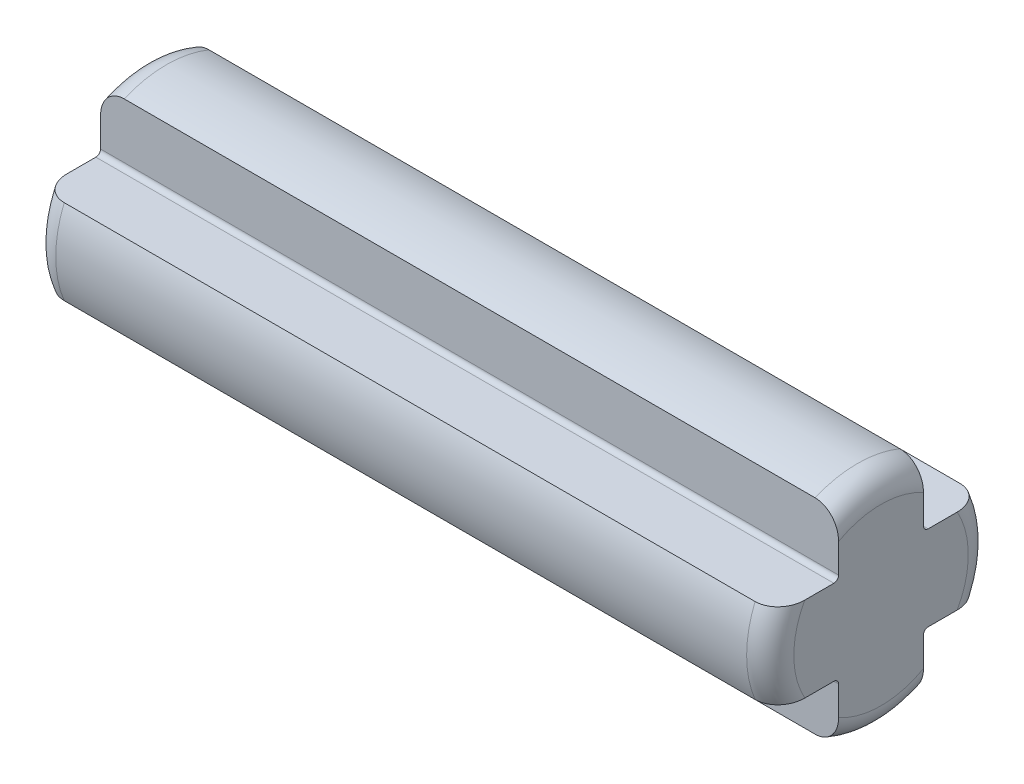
ISO-10303-21;
HEADER;
FILE_DESCRIPTION(('STEP AP214'),'2;1');
FILE_NAME('part.step','',(''),(''),'','','');
FILE_SCHEMA(('AUTOMOTIVE_DESIGN { 1 0 10303 214 1 1 1 1 }'));
ENDSEC;
DATA;
#1=APPLICATION_CONTEXT('core data for automotive mechanical design processes');
#2=APPLICATION_PROTOCOL_DEFINITION('international standard','automotive_design',2000,#1);
#3=PRODUCT_CONTEXT('',#1,'mechanical');
#4=PRODUCT('Part','Part','',(#3));
#5=PRODUCT_RELATED_PRODUCT_CATEGORY('part','',(#4));
#6=PRODUCT_DEFINITION_FORMATION('','',#4);
#7=PRODUCT_DEFINITION_CONTEXT('part definition',#1,'design');
#8=PRODUCT_DEFINITION('design','',#6,#7);
#9=PRODUCT_DEFINITION_SHAPE('','',#8);
#10=(LENGTH_UNIT() NAMED_UNIT(*) SI_UNIT(.MILLI.,.METRE.));
#11=(NAMED_UNIT(*) PLANE_ANGLE_UNIT() SI_UNIT($,.RADIAN.));
#12=(NAMED_UNIT(*) SI_UNIT($,.STERADIAN.) SOLID_ANGLE_UNIT());
#13=UNCERTAINTY_MEASURE_WITH_UNIT(LENGTH_MEASURE(1.E-05),#10,'distance_accuracy_value','');
#14=(GEOMETRIC_REPRESENTATION_CONTEXT(3) GLOBAL_UNCERTAINTY_ASSIGNED_CONTEXT((#13)) GLOBAL_UNIT_ASSIGNED_CONTEXT((#10,
#11,#12)) REPRESENTATION_CONTEXT('',''));
#15=CARTESIAN_POINT('',(0.,0.,0.));
#16=DIRECTION('',(0.,0.,1.));
#17=DIRECTION('',(1.,0.,0.));
#18=AXIS2_PLACEMENT_3D('',#15,#16,#17);
#19=CARTESIAN_POINT('',(7.825,0.,0.));
#20=DIRECTION('',(-1.,0.,0.));
#21=DIRECTION('',(0.,0.,1.));
#22=AXIS2_PLACEMENT_3D('',#19,#20,#21);
#23=CYLINDRICAL_SURFACE('',#22,2.35);
#24=DIRECTION('',(-1.,0.,0.));
#25=VECTOR('',#24,1.);
#26=CARTESIAN_POINT('',(7.825,0.9,2.17082933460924));
#27=LINE('',#26,#25);
#28=CARTESIAN_POINT('',(7.325,0.9,2.17082933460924));
#29=VERTEX_POINT('',#28);
#30=CARTESIAN_POINT('',(-7.325,0.9,2.17082933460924));
#31=VERTEX_POINT('',#30);
#32=EDGE_CURVE('E250',#29,#31,#27,.T.);
#33=ORIENTED_EDGE('',*,*,#32,.T.);
#34=CARTESIAN_POINT('',(-7.325,0.,0.));
#35=DIRECTION('',(1.,0.,0.));
#36=DIRECTION('',(0.,0.,-1.));
#37=AXIS2_PLACEMENT_3D('',#34,#35,#36);
#38=CIRCLE('',#37,2.35);
#39=CARTESIAN_POINT('',(-7.325,-0.900000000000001,2.17082933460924));
#40=VERTEX_POINT('',#39);
#41=EDGE_CURVE('E515',#31,#40,#38,.T.);
#42=ORIENTED_EDGE('',*,*,#41,.T.);
#43=DIRECTION('',(-1.,0.,0.));
#44=VECTOR('',#43,1.);
#45=CARTESIAN_POINT('',(7.825,-0.900000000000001,2.17082933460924));
#46=LINE('',#45,#44);
#47=CARTESIAN_POINT('',(7.325,-0.900000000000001,2.17082933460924));
#48=VERTEX_POINT('',#47);
#49=EDGE_CURVE('E221',#48,#40,#46,.T.);
#50=ORIENTED_EDGE('',*,*,#49,.F.);
#51=CARTESIAN_POINT('',(7.325,0.,0.));
#52=DIRECTION('',(1.,0.,0.));
#53=DIRECTION('',(0.,0.,-1.));
#54=AXIS2_PLACEMENT_3D('',#51,#52,#53);
#55=CIRCLE('',#54,2.35);
#56=EDGE_CURVE('E370',#48,#29,#55,.F.);
#57=ORIENTED_EDGE('',*,*,#56,.T.);
#58=EDGE_LOOP('',(#33,#42,#50,#57));
#59=FACE_BOUND('',#58,.T.);
#60=ADVANCED_FACE('F37',(#59),#23,.T.);
#61=CARTESIAN_POINT('',(7.825,-0.900000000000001,2.17082933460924));
#62=DIRECTION('',(0.,1.,0.));
#63=DIRECTION('',(0.,0.,1.));
#64=AXIS2_PLACEMENT_3D('',#61,#62,#63);
#65=PLANE('',#64);
#66=ORIENTED_EDGE('',*,*,#49,.T.);
#67=CARTESIAN_POINT('',(-7.325,-0.900000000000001,2.17082933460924));
#68=CARTESIAN_POINT('',(-7.35148338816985,-0.900000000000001,2.17085986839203));
#69=CARTESIAN_POINT('',(-7.37794986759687,-0.900000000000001,2.16855372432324));
#70=CARTESIAN_POINT('',(-7.43004532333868,-0.900000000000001,2.15950506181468));
#71=CARTESIAN_POINT('',(-7.45567629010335,-0.900000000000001,2.15277404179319));
#72=CARTESIAN_POINT('',(-7.50543871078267,-0.900000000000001,2.1351114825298));
#73=CARTESIAN_POINT('',(-7.52957034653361,-0.900000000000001,2.12418045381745));
#74=CARTESIAN_POINT('',(-7.57572512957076,-0.900000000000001,2.09852306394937));
#75=CARTESIAN_POINT('',(-7.59774756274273,-0.900000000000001,2.0837954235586));
#76=CARTESIAN_POINT('',(-7.6397234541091,-0.900000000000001,2.05060839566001));
#77=CARTESIAN_POINT('',(-7.6596070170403,-0.900000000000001,2.03206082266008));
#78=CARTESIAN_POINT('',(-7.69622437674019,-0.900000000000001,1.99209288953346));
#79=CARTESIAN_POINT('',(-7.71295793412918,-0.900000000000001,1.97067231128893));
#80=CARTESIAN_POINT('',(-7.74409731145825,-0.900000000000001,1.92396602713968));
#81=CARTESIAN_POINT('',(-7.75825279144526,-0.900000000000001,1.89851375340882));
#82=CARTESIAN_POINT('',(-7.78252472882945,-0.900000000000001,1.84573102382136));
#83=CARTESIAN_POINT('',(-7.79263675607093,-0.900000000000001,1.81839854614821));
#84=CARTESIAN_POINT('',(-7.80888669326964,-0.900000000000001,1.76219756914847));
#85=CARTESIAN_POINT('',(-7.81497027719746,-0.900000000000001,1.73331353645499));
#86=CARTESIAN_POINT('',(-7.82302704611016,-0.900000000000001,1.67505065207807));
#87=CARTESIAN_POINT('',(-7.82501091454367,-0.900000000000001,1.64567328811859));
#88=CARTESIAN_POINT('',(-7.825,-0.900000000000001,1.61632298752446));
#89=B_SPLINE_CURVE_WITH_KNOTS('',3,(#67,#68,#69,#70,#71,#72,#73,#74,#75,#76,#77,#78,#79,#80,#81,
#82,#83,#84,#85,#86,#87,#88),.UNSPECIFIED.,.F.,.F.,(4,2,2,2,2,2,2,2,2,2,4),(0.,
0.0793238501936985,0.158442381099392,0.237551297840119,0.316686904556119,0.397909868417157,
0.479139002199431,0.566147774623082,0.653251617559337,0.741507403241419,0.829532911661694),.UNSPECIFIED.);
#90=CARTESIAN_POINT('',(-7.825,-0.900000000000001,1.61632298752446));
#91=VERTEX_POINT('',#90);
#92=EDGE_CURVE('E390',#40,#91,#89,.T.);
#93=ORIENTED_EDGE('',*,*,#92,.T.);
#94=DIRECTION('',(0.,0.,-1.));
#95=VECTOR('',#94,1.);
#96=CARTESIAN_POINT('',(-7.825,-0.900000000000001,2.17082933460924));
#97=LINE('',#96,#95);
#98=CARTESIAN_POINT('',(-7.825,-0.900000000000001,0.999999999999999));
#99=VERTEX_POINT('',#98);
#100=EDGE_CURVE('E218',#91,#99,#97,.T.);
#101=ORIENTED_EDGE('',*,*,#100,.T.);
#102=DIRECTION('',(-1.,0.,0.));
#103=VECTOR('',#102,1.);
#104=CARTESIAN_POINT('',(7.825,-0.900000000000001,0.999999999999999));
#105=LINE('',#104,#103);
#106=CARTESIAN_POINT('',(7.825,-0.900000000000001,0.999999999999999));
#107=VERTEX_POINT('',#106);
#108=EDGE_CURVE('E214',#107,#99,#105,.T.);
#109=ORIENTED_EDGE('',*,*,#108,.F.);
#110=DIRECTION('',(0.,0.,-1.));
#111=VECTOR('',#110,1.);
#112=CARTESIAN_POINT('',(7.825,-0.900000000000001,2.17082933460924));
#113=LINE('',#112,#111);
#114=CARTESIAN_POINT('',(7.825,-0.900000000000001,1.61632298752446));
#115=VERTEX_POINT('',#114);
#116=EDGE_CURVE('E201',#115,#107,#113,.T.);
#117=ORIENTED_EDGE('',*,*,#116,.F.);
#118=CARTESIAN_POINT('',(7.825,-0.900000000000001,1.61632298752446));
#119=CARTESIAN_POINT('',(7.8250222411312,-0.900000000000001,1.65066661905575));
#120=CARTESIAN_POINT('',(7.8222983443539,-0.900000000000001,1.68506058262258));
#121=CARTESIAN_POINT('',(7.8112156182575,-0.900000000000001,1.75308687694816));
#122=CARTESIAN_POINT('',(7.80283034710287,-0.900000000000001,1.78671486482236));
#123=CARTESIAN_POINT('',(7.78024199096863,-0.900000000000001,1.85211366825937));
#124=CARTESIAN_POINT('',(7.76601955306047,-0.900000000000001,1.88387790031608));
#125=CARTESIAN_POINT('',(7.73191319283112,-0.900000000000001,1.94414749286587));
#126=CARTESIAN_POINT('',(7.71204168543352,-0.900000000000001,1.97265980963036));
#127=CARTESIAN_POINT('',(7.66922246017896,-0.900000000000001,2.02268935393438));
#128=CARTESIAN_POINT('',(7.64675261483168,-0.900000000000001,2.04461521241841));
#129=CARTESIAN_POINT('',(7.59808909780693,-0.900000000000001,2.08389547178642));
#130=CARTESIAN_POINT('',(7.57189528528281,-0.900000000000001,2.10124969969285));
#131=CARTESIAN_POINT('',(7.51934384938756,-0.900000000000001,2.12912089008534));
#132=CARTESIAN_POINT('',(7.49325091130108,-0.900000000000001,2.14013932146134));
#133=CARTESIAN_POINT('',(7.43953410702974,-0.900000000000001,2.15730052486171));
#134=CARTESIAN_POINT('',(7.41191341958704,-0.900000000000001,2.1634530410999));
#135=CARTESIAN_POINT('',(7.37421356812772,-0.900000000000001,2.16830749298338));
#136=CARTESIAN_POINT('',(7.36438668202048,-0.900000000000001,2.1692533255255));
#137=CARTESIAN_POINT('',(7.34470815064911,-0.900000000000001,2.17051341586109));
#138=CARTESIAN_POINT('',(7.33485656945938,-0.900000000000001,2.17082867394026));
#139=CARTESIAN_POINT('',(7.325,-0.900000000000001,2.17082933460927));
#140=B_SPLINE_CURVE_WITH_KNOTS('',3,(#118,#119,#120,#121,#122,#123,#124,#125,#126,#127,#128,
#129,#130,#131,#132,#133,#134,#135,#136,#137,#138,#139),.UNSPECIFIED.,.F.,.F.,(4,2,2,2,2,2,2,2,
2,2,4),(0.,0.10300027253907,0.206484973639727,0.310315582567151,0.413919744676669,
0.507586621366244,0.601257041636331,0.685799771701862,0.770172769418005,0.799774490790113,
0.829329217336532),.UNSPECIFIED.);
#141=EDGE_CURVE('E520',#115,#48,#140,.T.);
#142=ORIENTED_EDGE('',*,*,#141,.T.);
#143=EDGE_LOOP('',(#66,#93,#101,#109,#117,#142));
#144=FACE_BOUND('',#143,.T.);
#145=ADVANCED_FACE('F216',(#144),#65,.F.);
#146=CARTESIAN_POINT('',(7.825,-1.,0.999999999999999));
#147=DIRECTION('',(-1.,0.,0.));
#148=DIRECTION('',(0.,0.,1.));
#149=AXIS2_PLACEMENT_3D('',#146,#147,#148);
#150=CYLINDRICAL_SURFACE('',#149,0.0999999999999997);
#151=CARTESIAN_POINT('',(-7.825,-1.,0.999999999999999));
#152=DIRECTION('',(-1.,0.,0.));
#153=DIRECTION('',(0.,0.,1.));
#154=AXIS2_PLACEMENT_3D('',#151,#152,#153);
#155=CIRCLE('',#154,0.0999999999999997);
#156=CARTESIAN_POINT('',(-7.825,-1.,0.899999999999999));
#157=VERTEX_POINT('',#156);
#158=EDGE_CURVE('E252',#99,#157,#155,.T.);
#159=ORIENTED_EDGE('',*,*,#158,.T.);
#160=DIRECTION('',(-1.,0.,0.));
#161=VECTOR('',#160,1.);
#162=CARTESIAN_POINT('',(7.825,-1.,0.899999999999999));
#163=LINE('',#162,#161);
#164=CARTESIAN_POINT('',(7.825,-1.,0.899999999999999));
#165=VERTEX_POINT('',#164);
#166=EDGE_CURVE('E222',#165,#157,#163,.T.);
#167=ORIENTED_EDGE('',*,*,#166,.F.);
#168=CARTESIAN_POINT('',(7.825,-1.,0.999999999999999));
#169=DIRECTION('',(-1.,0.,0.));
#170=DIRECTION('',(0.,0.,1.));
#171=AXIS2_PLACEMENT_3D('',#168,#169,#170);
#172=CIRCLE('',#171,0.0999999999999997);
#173=EDGE_CURVE('E207',#107,#165,#172,.T.);
#174=ORIENTED_EDGE('',*,*,#173,.F.);
#175=ORIENTED_EDGE('',*,*,#108,.T.);
#176=EDGE_LOOP('',(#159,#167,#174,#175));
#177=FACE_BOUND('',#176,.T.);
#178=ADVANCED_FACE('F224',(#177),#150,.F.);
#179=CARTESIAN_POINT('',(7.825,-2.17082933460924,0.899999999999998));
#180=DIRECTION('',(0.,0.,-1.));
#181=DIRECTION('',(0.,1.,0.));
#182=AXIS2_PLACEMENT_3D('',#179,#180,#181);
#183=PLANE('',#182);
#184=DIRECTION('',(0.,-1.,0.));
#185=VECTOR('',#184,1.);
#186=CARTESIAN_POINT('',(-7.825,-2.17082933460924,0.899999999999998));
#187=LINE('',#186,#185);
#188=CARTESIAN_POINT('',(-7.825,-1.61632298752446,0.899999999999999));
#189=VERTEX_POINT('',#188);
#190=EDGE_CURVE('E254',#157,#189,#187,.T.);
#191=ORIENTED_EDGE('',*,*,#190,.T.);
#192=CARTESIAN_POINT('',(-7.825,-1.61632298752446,0.899999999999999));
#193=CARTESIAN_POINT('',(-7.8250222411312,-1.65066661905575,0.899999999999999));
#194=CARTESIAN_POINT('',(-7.8222983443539,-1.68506058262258,0.899999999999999));
#195=CARTESIAN_POINT('',(-7.8112156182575,-1.75308687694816,0.899999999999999));
#196=CARTESIAN_POINT('',(-7.80283034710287,-1.78671486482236,0.899999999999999));
#197=CARTESIAN_POINT('',(-7.78024199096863,-1.85211366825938,0.899999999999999));
#198=CARTESIAN_POINT('',(-7.76601955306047,-1.88387790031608,0.899999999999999));
#199=CARTESIAN_POINT('',(-7.73191319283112,-1.94414749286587,0.899999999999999));
#200=CARTESIAN_POINT('',(-7.71204168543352,-1.97265980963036,0.899999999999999));
#201=CARTESIAN_POINT('',(-7.66922246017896,-2.02268935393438,0.899999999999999));
#202=CARTESIAN_POINT('',(-7.64675261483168,-2.04461521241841,0.899999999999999));
#203=CARTESIAN_POINT('',(-7.59808909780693,-2.08389547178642,0.899999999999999));
#204=CARTESIAN_POINT('',(-7.57189528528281,-2.10124969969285,0.899999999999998));
#205=CARTESIAN_POINT('',(-7.51934384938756,-2.12912089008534,0.899999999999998));
#206=CARTESIAN_POINT('',(-7.49325091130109,-2.14013932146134,0.899999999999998));
#207=CARTESIAN_POINT('',(-7.43953410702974,-2.15730052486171,0.899999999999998));
#208=CARTESIAN_POINT('',(-7.41191341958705,-2.1634530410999,0.899999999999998));
#209=CARTESIAN_POINT('',(-7.37421356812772,-2.16830749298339,0.899999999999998));
#210=CARTESIAN_POINT('',(-7.36438668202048,-2.1692533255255,0.899999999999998));
#211=CARTESIAN_POINT('',(-7.34470815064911,-2.17051341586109,0.899999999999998));
#212=CARTESIAN_POINT('',(-7.33485656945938,-2.17082867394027,0.899999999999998));
#213=CARTESIAN_POINT('',(-7.325,-2.17082933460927,0.899999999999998));
#214=B_SPLINE_CURVE_WITH_KNOTS('',3,(#192,#193,#194,#195,#196,#197,#198,#199,#200,#201,#202,
#203,#204,#205,#206,#207,#208,#209,#210,#211,#212,#213),.UNSPECIFIED.,.F.,.F.,(4,2,2,2,2,2,2,2,
2,2,4),(0.,0.10300027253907,0.206484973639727,0.310315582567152,0.413919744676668,
0.507586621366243,0.601257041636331,0.68579977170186,0.770172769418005,0.799774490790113,
0.829329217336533),.UNSPECIFIED.);
#215=CARTESIAN_POINT('',(-7.325,-2.17082933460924,0.899999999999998));
#216=VERTEX_POINT('',#215);
#217=EDGE_CURVE('E365',#189,#216,#214,.T.);
#218=ORIENTED_EDGE('',*,*,#217,.T.);
#219=DIRECTION('',(-1.,0.,0.));
#220=VECTOR('',#219,1.);
#221=CARTESIAN_POINT('',(7.825,-2.17082933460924,0.899999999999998));
#222=LINE('',#221,#220);
#223=CARTESIAN_POINT('',(7.325,-2.17082933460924,0.899999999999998));
#224=VERTEX_POINT('',#223);
#225=EDGE_CURVE('E312',#224,#216,#222,.T.);
#226=ORIENTED_EDGE('',*,*,#225,.F.);
#227=CARTESIAN_POINT('',(7.325,-2.17082933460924,0.899999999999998));
#228=CARTESIAN_POINT('',(7.35148338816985,-2.17085986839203,0.899999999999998));
#229=CARTESIAN_POINT('',(7.37794986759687,-2.16855372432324,0.899999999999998));
#230=CARTESIAN_POINT('',(7.43004532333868,-2.15950506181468,0.899999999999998));
#231=CARTESIAN_POINT('',(7.45567629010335,-2.15277404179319,0.899999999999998));
#232=CARTESIAN_POINT('',(7.50543871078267,-2.1351114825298,0.899999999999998));
#233=CARTESIAN_POINT('',(7.52957034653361,-2.12418045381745,0.899999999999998));
#234=CARTESIAN_POINT('',(7.57572512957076,-2.09852306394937,0.899999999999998));
#235=CARTESIAN_POINT('',(7.59774756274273,-2.0837954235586,0.899999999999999));
#236=CARTESIAN_POINT('',(7.6397234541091,-2.05060839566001,0.899999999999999));
#237=CARTESIAN_POINT('',(7.6596070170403,-2.03206082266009,0.899999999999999));
#238=CARTESIAN_POINT('',(7.69622437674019,-1.99209288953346,0.899999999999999));
#239=CARTESIAN_POINT('',(7.71295793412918,-1.97067231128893,0.899999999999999));
#240=CARTESIAN_POINT('',(7.74409731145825,-1.92396602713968,0.899999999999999));
#241=CARTESIAN_POINT('',(7.75825279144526,-1.89851375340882,0.899999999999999));
#242=CARTESIAN_POINT('',(7.78252472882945,-1.84573102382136,0.899999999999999));
#243=CARTESIAN_POINT('',(7.79263675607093,-1.81839854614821,0.899999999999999));
#244=CARTESIAN_POINT('',(7.80888669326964,-1.76219756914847,0.899999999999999));
#245=CARTESIAN_POINT('',(7.81497027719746,-1.733313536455,0.899999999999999));
#246=CARTESIAN_POINT('',(7.82302704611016,-1.67505065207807,0.899999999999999));
#247=CARTESIAN_POINT('',(7.82501091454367,-1.64567328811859,0.899999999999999));
#248=CARTESIAN_POINT('',(7.825,-1.61632298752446,0.899999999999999));
#249=B_SPLINE_CURVE_WITH_KNOTS('',3,(#227,#228,#229,#230,#231,#232,#233,#234,#235,#236,#237,
#238,#239,#240,#241,#242,#243,#244,#245,#246,#247,#248),.UNSPECIFIED.,.F.,.F.,(4,2,2,2,2,2,2,2,
2,2,4),(0.,0.0793238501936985,0.158442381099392,0.237551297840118,0.316686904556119,
0.397909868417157,0.479139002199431,0.566147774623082,0.653251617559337,0.741507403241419,
0.829532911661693),.UNSPECIFIED.);
#250=CARTESIAN_POINT('',(7.825,-1.61632298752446,0.899999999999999));
#251=VERTEX_POINT('',#250);
#252=EDGE_CURVE('E359',#224,#251,#249,.T.);
#253=ORIENTED_EDGE('',*,*,#252,.T.);
#254=DIRECTION('',(0.,-1.,0.));
#255=VECTOR('',#254,1.);
#256=CARTESIAN_POINT('',(7.825,-2.17082933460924,0.899999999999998));
#257=LINE('',#256,#255);
#258=EDGE_CURVE('E227',#165,#251,#257,.T.);
#259=ORIENTED_EDGE('',*,*,#258,.F.);
#260=ORIENTED_EDGE('',*,*,#166,.T.);
#261=EDGE_LOOP('',(#191,#218,#226,#253,#259,#260));
#262=FACE_BOUND('',#261,.T.);
#263=ADVANCED_FACE('F350',(#262),#183,.F.);
#264=CARTESIAN_POINT('',(7.825,0.,0.));
#265=DIRECTION('',(-1.,0.,0.));
#266=DIRECTION('',(0.,0.,1.));
#267=AXIS2_PLACEMENT_3D('',#264,#265,#266);
#268=CYLINDRICAL_SURFACE('',#267,2.35);
#269=ORIENTED_EDGE('',*,*,#225,.T.);
#270=CARTESIAN_POINT('',(-7.325,0.,0.));
#271=DIRECTION('',(1.,0.,0.));
#272=DIRECTION('',(0.,0.,-1.));
#273=AXIS2_PLACEMENT_3D('',#270,#271,#272);
#274=CIRCLE('',#273,2.35);
#275=CARTESIAN_POINT('',(-7.325,-2.17082933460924,-0.9));
#276=VERTEX_POINT('',#275);
#277=EDGE_CURVE('E319',#216,#276,#274,.T.);
#278=ORIENTED_EDGE('',*,*,#277,.T.);
#279=DIRECTION('',(-1.,0.,0.));
#280=VECTOR('',#279,1.);
#281=CARTESIAN_POINT('',(7.825,-2.17082933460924,-0.9));
#282=LINE('',#281,#280);
#283=CARTESIAN_POINT('',(7.325,-2.17082933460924,-0.9));
#284=VERTEX_POINT('',#283);
#285=EDGE_CURVE('E309',#284,#276,#282,.T.);
#286=ORIENTED_EDGE('',*,*,#285,.F.);
#287=CARTESIAN_POINT('',(7.325,0.,0.));
#288=DIRECTION('',(1.,0.,0.));
#289=DIRECTION('',(0.,0.,-1.));
#290=AXIS2_PLACEMENT_3D('',#287,#288,#289);
#291=CIRCLE('',#290,2.35);
#292=EDGE_CURVE('E317',#284,#224,#291,.F.);
#293=ORIENTED_EDGE('',*,*,#292,.T.);
#294=EDGE_LOOP('',(#269,#278,#286,#293));
#295=FACE_BOUND('',#294,.T.);
#296=ADVANCED_FACE('F344',(#295),#268,.T.);
#297=CARTESIAN_POINT('',(7.825,-2.17082933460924,-0.9));
#298=DIRECTION('',(0.,0.,1.));
#299=DIRECTION('',(0.,-1.,0.));
#300=AXIS2_PLACEMENT_3D('',#297,#298,#299);
#301=PLANE('',#300);
#302=ORIENTED_EDGE('',*,*,#285,.T.);
#303=CARTESIAN_POINT('',(-7.325,-2.17082933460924,-0.9));
#304=CARTESIAN_POINT('',(-7.35148338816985,-2.17085986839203,-0.9));
#305=CARTESIAN_POINT('',(-7.37794986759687,-2.16855372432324,-0.9));
#306=CARTESIAN_POINT('',(-7.43004532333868,-2.15950506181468,-0.9));
#307=CARTESIAN_POINT('',(-7.45567629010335,-2.15277404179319,-0.9));
#308=CARTESIAN_POINT('',(-7.50543871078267,-2.1351114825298,-0.9));
#309=CARTESIAN_POINT('',(-7.52957034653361,-2.12418045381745,-0.9));
#310=CARTESIAN_POINT('',(-7.57572512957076,-2.09852306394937,-0.9));
#311=CARTESIAN_POINT('',(-7.59774756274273,-2.0837954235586,-0.9));
#312=CARTESIAN_POINT('',(-7.6397234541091,-2.05060839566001,-0.9));
#313=CARTESIAN_POINT('',(-7.6596070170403,-2.03206082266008,-0.9));
#314=CARTESIAN_POINT('',(-7.69622437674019,-1.99209288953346,-0.9));
#315=CARTESIAN_POINT('',(-7.71295793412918,-1.97067231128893,-0.9));
#316=CARTESIAN_POINT('',(-7.74409731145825,-1.92396602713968,-0.9));
#317=CARTESIAN_POINT('',(-7.75825279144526,-1.89851375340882,-0.9));
#318=CARTESIAN_POINT('',(-7.78252472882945,-1.84573102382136,-0.9));
#319=CARTESIAN_POINT('',(-7.79263675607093,-1.81839854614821,-0.9));
#320=CARTESIAN_POINT('',(-7.80888669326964,-1.76219756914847,-0.9));
#321=CARTESIAN_POINT('',(-7.81497027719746,-1.733313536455,-0.9));
#322=CARTESIAN_POINT('',(-7.82302704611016,-1.67505065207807,-0.9));
#323=CARTESIAN_POINT('',(-7.82501091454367,-1.64567328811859,-0.9));
#324=CARTESIAN_POINT('',(-7.825,-1.61632298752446,-0.9));
#325=B_SPLINE_CURVE_WITH_KNOTS('',3,(#303,#304,#305,#306,#307,#308,#309,#310,#311,#312,#313,
#314,#315,#316,#317,#318,#319,#320,#321,#322,#323,#324),.UNSPECIFIED.,.F.,.F.,(4,2,2,2,2,2,2,2,
2,2,4),(0.,0.0793238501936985,0.158442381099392,0.237551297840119,0.316686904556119,
0.397909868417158,0.479139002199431,0.566147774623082,0.653251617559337,0.74150740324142,
0.829532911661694),.UNSPECIFIED.);
#326=CARTESIAN_POINT('',(-7.825,-1.61632298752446,-0.9));
#327=VERTEX_POINT('',#326);
#328=EDGE_CURVE('E329',#276,#327,#325,.T.);
#329=ORIENTED_EDGE('',*,*,#328,.T.);
#330=DIRECTION('',(0.,1.,0.));
#331=VECTOR('',#330,1.);
#332=CARTESIAN_POINT('',(-7.825,-2.17082933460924,-0.9));
#333=LINE('',#332,#331);
#334=CARTESIAN_POINT('',(-7.825,-1.,-0.9));
#335=VERTEX_POINT('',#334);
#336=EDGE_CURVE('E257',#327,#335,#333,.T.);
#337=ORIENTED_EDGE('',*,*,#336,.T.);
#338=DIRECTION('',(-1.,0.,0.));
#339=VECTOR('',#338,1.);
#340=CARTESIAN_POINT('',(7.825,-1.,-0.9));
#341=LINE('',#340,#339);
#342=CARTESIAN_POINT('',(7.825,-1.,-0.9));
#343=VERTEX_POINT('',#342);
#344=EDGE_CURVE('E306',#343,#335,#341,.T.);
#345=ORIENTED_EDGE('',*,*,#344,.F.);
#346=DIRECTION('',(0.,1.,0.));
#347=VECTOR('',#346,1.);
#348=CARTESIAN_POINT('',(7.825,-2.17082933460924,-0.9));
#349=LINE('',#348,#347);
#350=CARTESIAN_POINT('',(7.825,-1.61632298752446,-0.9));
#351=VERTEX_POINT('',#350);
#352=EDGE_CURVE('E229',#351,#343,#349,.T.);
#353=ORIENTED_EDGE('',*,*,#352,.F.);
#354=CARTESIAN_POINT('',(7.825,-1.61632298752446,-0.9));
#355=CARTESIAN_POINT('',(7.8250222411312,-1.65066661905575,-0.9));
#356=CARTESIAN_POINT('',(7.8222983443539,-1.68506058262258,-0.9));
#357=CARTESIAN_POINT('',(7.8112156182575,-1.75308687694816,-0.9));
#358=CARTESIAN_POINT('',(7.80283034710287,-1.78671486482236,-0.9));
#359=CARTESIAN_POINT('',(7.78024199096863,-1.85211366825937,-0.9));
#360=CARTESIAN_POINT('',(7.76601955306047,-1.88387790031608,-0.9));
#361=CARTESIAN_POINT('',(7.73191319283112,-1.94414749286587,-0.9));
#362=CARTESIAN_POINT('',(7.71204168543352,-1.97265980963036,-0.9));
#363=CARTESIAN_POINT('',(7.66922246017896,-2.02268935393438,-0.9));
#364=CARTESIAN_POINT('',(7.64675261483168,-2.04461521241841,-0.9));
#365=CARTESIAN_POINT('',(7.59808909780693,-2.08389547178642,-0.9));
#366=CARTESIAN_POINT('',(7.57189528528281,-2.10124969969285,-0.9));
#367=CARTESIAN_POINT('',(7.51934384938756,-2.12912089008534,-0.9));
#368=CARTESIAN_POINT('',(7.49325091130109,-2.14013932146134,-0.9));
#369=CARTESIAN_POINT('',(7.43953410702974,-2.15730052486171,-0.9));
#370=CARTESIAN_POINT('',(7.41191341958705,-2.1634530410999,-0.9));
#371=CARTESIAN_POINT('',(7.37421356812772,-2.16830749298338,-0.9));
#372=CARTESIAN_POINT('',(7.36438668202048,-2.1692533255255,-0.9));
#373=CARTESIAN_POINT('',(7.34470815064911,-2.17051341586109,-0.9));
#374=CARTESIAN_POINT('',(7.33485656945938,-2.17082867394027,-0.9));
#375=CARTESIAN_POINT('',(7.325,-2.17082933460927,-0.9));
#376=B_SPLINE_CURVE_WITH_KNOTS('',3,(#354,#355,#356,#357,#358,#359,#360,#361,#362,#363,#364,
#365,#366,#367,#368,#369,#370,#371,#372,#373,#374,#375),.UNSPECIFIED.,.F.,.F.,(4,2,2,2,2,2,2,2,
2,2,4),(0.,0.10300027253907,0.206484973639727,0.310315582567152,0.413919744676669,
0.507586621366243,0.60125704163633,0.68579977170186,0.770172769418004,0.799774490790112,
0.829329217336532),.UNSPECIFIED.);
#377=EDGE_CURVE('E322',#351,#284,#376,.T.);
#378=ORIENTED_EDGE('',*,*,#377,.T.);
#379=EDGE_LOOP('',(#302,#329,#337,#345,#353,#378));
#380=FACE_BOUND('',#379,.T.);
#381=ADVANCED_FACE('F338',(#380),#301,.F.);
#382=CARTESIAN_POINT('',(7.825,-1.,-1.));
#383=DIRECTION('',(-1.,0.,0.));
#384=DIRECTION('',(0.,0.,1.));
#385=AXIS2_PLACEMENT_3D('',#382,#383,#384);
#386=CYLINDRICAL_SURFACE('',#385,0.0999999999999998);
#387=CARTESIAN_POINT('',(-7.825,-1.,-1.));
#388=DIRECTION('',(-1.,0.,0.));
#389=DIRECTION('',(0.,0.,-1.));
#390=AXIS2_PLACEMENT_3D('',#387,#388,#389);
#391=CIRCLE('',#390,0.0999999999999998);
#392=CARTESIAN_POINT('',(-7.825,-0.9,-1.));
#393=VERTEX_POINT('',#392);
#394=EDGE_CURVE('E259',#335,#393,#391,.T.);
#395=ORIENTED_EDGE('',*,*,#394,.T.);
#396=DIRECTION('',(-1.,0.,0.));
#397=VECTOR('',#396,1.);
#398=CARTESIAN_POINT('',(7.825,-0.9,-1.));
#399=LINE('',#398,#397);
#400=CARTESIAN_POINT('',(7.825,-0.9,-1.));
#401=VERTEX_POINT('',#400);
#402=EDGE_CURVE('E303',#401,#393,#399,.T.);
#403=ORIENTED_EDGE('',*,*,#402,.F.);
#404=CARTESIAN_POINT('',(7.825,-1.,-1.));
#405=DIRECTION('',(-1.,0.,0.));
#406=DIRECTION('',(0.,0.,-1.));
#407=AXIS2_PLACEMENT_3D('',#404,#405,#406);
#408=CIRCLE('',#407,0.0999999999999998);
#409=EDGE_CURVE('E233',#343,#401,#408,.T.);
#410=ORIENTED_EDGE('',*,*,#409,.F.);
#411=ORIENTED_EDGE('',*,*,#344,.T.);
#412=EDGE_LOOP('',(#395,#403,#410,#411));
#413=FACE_BOUND('',#412,.T.);
#414=ADVANCED_FACE('F343',(#413),#386,.F.);
#415=CARTESIAN_POINT('',(7.825,-0.900000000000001,-2.17082933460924));
#416=DIRECTION('',(0.,1.,0.));
#417=DIRECTION('',(0.,0.,1.));
#418=AXIS2_PLACEMENT_3D('',#415,#416,#417);
#419=PLANE('',#418);
#420=DIRECTION('',(0.,0.,-1.));
#421=VECTOR('',#420,1.);
#422=CARTESIAN_POINT('',(-7.825,-0.900000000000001,-2.17082933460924));
#423=LINE('',#422,#421);
#424=CARTESIAN_POINT('',(-7.825,-0.9,-1.61632298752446));
#425=VERTEX_POINT('',#424);
#426=EDGE_CURVE('E261',#393,#425,#423,.T.);
#427=ORIENTED_EDGE('',*,*,#426,.T.);
#428=CARTESIAN_POINT('',(-7.825,-0.9,-1.61632298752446));
#429=CARTESIAN_POINT('',(-7.8250222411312,-0.9,-1.65066661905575));
#430=CARTESIAN_POINT('',(-7.8222983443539,-0.9,-1.68506058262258));
#431=CARTESIAN_POINT('',(-7.8112156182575,-0.9,-1.75308687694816));
#432=CARTESIAN_POINT('',(-7.80283034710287,-0.9,-1.78671486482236));
#433=CARTESIAN_POINT('',(-7.78024199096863,-0.9,-1.85211366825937));
#434=CARTESIAN_POINT('',(-7.76601955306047,-0.9,-1.88387790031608));
#435=CARTESIAN_POINT('',(-7.73191319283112,-0.9,-1.94414749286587));
#436=CARTESIAN_POINT('',(-7.71204168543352,-0.9,-1.97265980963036));
#437=CARTESIAN_POINT('',(-7.66922246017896,-0.9,-2.02268935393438));
#438=CARTESIAN_POINT('',(-7.64675261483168,-0.900000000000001,-2.04461521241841));
#439=CARTESIAN_POINT('',(-7.59808909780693,-0.900000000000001,-2.08389547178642));
#440=CARTESIAN_POINT('',(-7.57189528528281,-0.900000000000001,-2.10124969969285));
#441=CARTESIAN_POINT('',(-7.51934384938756,-0.900000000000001,-2.12912089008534));
#442=CARTESIAN_POINT('',(-7.49325091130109,-0.900000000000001,-2.14013932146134));
#443=CARTESIAN_POINT('',(-7.43953410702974,-0.900000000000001,-2.15730052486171));
#444=CARTESIAN_POINT('',(-7.41191341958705,-0.900000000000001,-2.1634530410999));
#445=CARTESIAN_POINT('',(-7.37421356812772,-0.900000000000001,-2.16830749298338));
#446=CARTESIAN_POINT('',(-7.36438668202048,-0.900000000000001,-2.1692533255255));
#447=CARTESIAN_POINT('',(-7.34470815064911,-0.900000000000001,-2.17051341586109));
#448=CARTESIAN_POINT('',(-7.33485656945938,-0.900000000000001,-2.17082867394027));
#449=CARTESIAN_POINT('',(-7.325,-0.900000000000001,-2.17082933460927));
#450=B_SPLINE_CURVE_WITH_KNOTS('',3,(#428,#429,#430,#431,#432,#433,#434,#435,#436,#437,#438,
#439,#440,#441,#442,#443,#444,#445,#446,#447,#448,#449),.UNSPECIFIED.,.F.,.F.,(4,2,2,2,2,2,2,2,
2,2,4),(0.,0.10300027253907,0.206484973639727,0.310315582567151,0.413919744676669,
0.507586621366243,0.601257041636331,0.68579977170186,0.770172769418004,0.799774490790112,
0.829329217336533),.UNSPECIFIED.);
#451=CARTESIAN_POINT('',(-7.325,-0.9,-2.17082933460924));
#452=VERTEX_POINT('',#451);
#453=EDGE_CURVE('E489',#425,#452,#450,.T.);
#454=ORIENTED_EDGE('',*,*,#453,.T.);
#455=DIRECTION('',(-1.,0.,0.));
#456=VECTOR('',#455,1.);
#457=CARTESIAN_POINT('',(7.825,-0.9,-2.17082933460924));
#458=LINE('',#457,#456);
#459=CARTESIAN_POINT('',(7.325,-0.9,-2.17082933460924));
#460=VERTEX_POINT('',#459);
#461=EDGE_CURVE('E300',#460,#452,#458,.T.);
#462=ORIENTED_EDGE('',*,*,#461,.F.);
#463=CARTESIAN_POINT('',(7.325,-0.9,-2.17082933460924));
#464=CARTESIAN_POINT('',(7.35148338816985,-0.9,-2.17085986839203));
#465=CARTESIAN_POINT('',(7.37794986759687,-0.900000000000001,-2.16855372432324));
#466=CARTESIAN_POINT('',(7.43004532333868,-0.900000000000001,-2.15950506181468));
#467=CARTESIAN_POINT('',(7.45567629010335,-0.900000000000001,-2.15277404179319));
#468=CARTESIAN_POINT('',(7.50543871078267,-0.900000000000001,-2.1351114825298));
#469=CARTESIAN_POINT('',(7.52957034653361,-0.900000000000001,-2.12418045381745));
#470=CARTESIAN_POINT('',(7.57572512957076,-0.900000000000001,-2.09852306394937));
#471=CARTESIAN_POINT('',(7.59774756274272,-0.900000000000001,-2.0837954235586));
#472=CARTESIAN_POINT('',(7.6397234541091,-0.900000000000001,-2.05060839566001));
#473=CARTESIAN_POINT('',(7.6596070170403,-0.9,-2.03206082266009));
#474=CARTESIAN_POINT('',(7.69622437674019,-0.9,-1.99209288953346));
#475=CARTESIAN_POINT('',(7.71295793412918,-0.9,-1.97067231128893));
#476=CARTESIAN_POINT('',(7.74409731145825,-0.9,-1.92396602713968));
#477=CARTESIAN_POINT('',(7.75825279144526,-0.9,-1.89851375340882));
#478=CARTESIAN_POINT('',(7.78252472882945,-0.9,-1.84573102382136));
#479=CARTESIAN_POINT('',(7.79263675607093,-0.9,-1.81839854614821));
#480=CARTESIAN_POINT('',(7.80888669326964,-0.9,-1.76219756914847));
#481=CARTESIAN_POINT('',(7.81497027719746,-0.9,-1.733313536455));
#482=CARTESIAN_POINT('',(7.82302704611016,-0.9,-1.67505065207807));
#483=CARTESIAN_POINT('',(7.82501091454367,-0.9,-1.64567328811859));
#484=CARTESIAN_POINT('',(7.825,-0.9,-1.61632298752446));
#485=B_SPLINE_CURVE_WITH_KNOTS('',3,(#463,#464,#465,#466,#467,#468,#469,#470,#471,#472,#473,
#474,#475,#476,#477,#478,#479,#480,#481,#482,#483,#484),.UNSPECIFIED.,.F.,.F.,(4,2,2,2,2,2,2,2,
2,2,4),(0.,0.0793238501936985,0.158442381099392,0.237551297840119,0.316686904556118,
0.397909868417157,0.479139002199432,0.566147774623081,0.653251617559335,0.741507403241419,
0.829532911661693),.UNSPECIFIED.);
#486=CARTESIAN_POINT('',(7.825,-0.9,-1.61632298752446));
#487=VERTEX_POINT('',#486);
#488=EDGE_CURVE('E53',#460,#487,#485,.T.);
#489=ORIENTED_EDGE('',*,*,#488,.T.);
#490=DIRECTION('',(0.,0.,-1.));
#491=VECTOR('',#490,1.);
#492=CARTESIAN_POINT('',(7.825,-0.900000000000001,-2.17082933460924));
#493=LINE('',#492,#491);
#494=EDGE_CURVE('E235',#401,#487,#493,.T.);
#495=ORIENTED_EDGE('',*,*,#494,.F.);
#496=ORIENTED_EDGE('',*,*,#402,.T.);
#497=EDGE_LOOP('',(#427,#454,#462,#489,#495,#496));
#498=FACE_BOUND('',#497,.T.);
#499=ADVANCED_FACE('F496',(#498),#419,.F.);
#500=CARTESIAN_POINT('',(7.825,0.,0.));
#501=DIRECTION('',(-1.,0.,0.));
#502=DIRECTION('',(0.,0.,1.));
#503=AXIS2_PLACEMENT_3D('',#500,#501,#502);
#504=CYLINDRICAL_SURFACE('',#503,2.35);
#505=ORIENTED_EDGE('',*,*,#461,.T.);
#506=CARTESIAN_POINT('',(-7.325,0.,0.));
#507=DIRECTION('',(1.,0.,0.));
#508=DIRECTION('',(0.,0.,-1.));
#509=AXIS2_PLACEMENT_3D('',#506,#507,#508);
#510=CIRCLE('',#509,2.35);
#511=CARTESIAN_POINT('',(-7.325,0.900000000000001,-2.17082933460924));
#512=VERTEX_POINT('',#511);
#513=EDGE_CURVE('E575',#452,#512,#510,.T.);
#514=ORIENTED_EDGE('',*,*,#513,.T.);
#515=DIRECTION('',(-1.,0.,0.));
#516=VECTOR('',#515,1.);
#517=CARTESIAN_POINT('',(7.825,0.900000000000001,-2.17082933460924));
#518=LINE('',#517,#516);
#519=CARTESIAN_POINT('',(7.325,0.900000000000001,-2.17082933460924));
#520=VERTEX_POINT('',#519);
#521=EDGE_CURVE('E297',#520,#512,#518,.T.);
#522=ORIENTED_EDGE('',*,*,#521,.F.);
#523=CARTESIAN_POINT('',(7.325,0.,0.));
#524=DIRECTION('',(1.,0.,0.));
#525=DIRECTION('',(0.,0.,-1.));
#526=AXIS2_PLACEMENT_3D('',#523,#524,#525);
#527=CIRCLE('',#526,2.35);
#528=EDGE_CURVE('E574',#520,#460,#527,.F.);
#529=ORIENTED_EDGE('',*,*,#528,.T.);
#530=EDGE_LOOP('',(#505,#514,#522,#529));
#531=FACE_BOUND('',#530,.T.);
#532=ADVANCED_FACE('F464',(#531),#504,.T.);
#533=CARTESIAN_POINT('',(7.825,0.900000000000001,-2.17082933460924));
#534=DIRECTION('',(0.,-1.,0.));
#535=DIRECTION('',(0.,0.,-1.));
#536=AXIS2_PLACEMENT_3D('',#533,#534,#535);
#537=PLANE('',#536);
#538=ORIENTED_EDGE('',*,*,#521,.T.);
#539=CARTESIAN_POINT('',(-7.325,0.900000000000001,-2.17082933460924));
#540=CARTESIAN_POINT('',(-7.35148338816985,0.900000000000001,-2.17085986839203));
#541=CARTESIAN_POINT('',(-7.37794986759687,0.900000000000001,-2.16855372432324));
#542=CARTESIAN_POINT('',(-7.43004532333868,0.900000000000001,-2.15950506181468));
#543=CARTESIAN_POINT('',(-7.45567629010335,0.900000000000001,-2.15277404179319));
#544=CARTESIAN_POINT('',(-7.50543871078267,0.900000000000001,-2.1351114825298));
#545=CARTESIAN_POINT('',(-7.52957034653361,0.900000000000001,-2.12418045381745));
#546=CARTESIAN_POINT('',(-7.57572512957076,0.900000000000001,-2.09852306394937));
#547=CARTESIAN_POINT('',(-7.59774756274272,0.900000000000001,-2.0837954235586));
#548=CARTESIAN_POINT('',(-7.6397234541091,0.900000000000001,-2.05060839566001));
#549=CARTESIAN_POINT('',(-7.6596070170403,0.9,-2.03206082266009));
#550=CARTESIAN_POINT('',(-7.69622437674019,0.9,-1.99209288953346));
#551=CARTESIAN_POINT('',(-7.71295793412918,0.9,-1.97067231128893));
#552=CARTESIAN_POINT('',(-7.74409731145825,0.9,-1.92396602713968));
#553=CARTESIAN_POINT('',(-7.75825279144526,0.9,-1.89851375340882));
#554=CARTESIAN_POINT('',(-7.78252472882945,0.9,-1.84573102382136));
#555=CARTESIAN_POINT('',(-7.79263675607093,0.9,-1.81839854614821));
#556=CARTESIAN_POINT('',(-7.80888669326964,0.9,-1.76219756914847));
#557=CARTESIAN_POINT('',(-7.81497027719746,0.9,-1.733313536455));
#558=CARTESIAN_POINT('',(-7.82302704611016,0.9,-1.67505065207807));
#559=CARTESIAN_POINT('',(-7.82501091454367,0.9,-1.64567328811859));
#560=CARTESIAN_POINT('',(-7.825,0.9,-1.61632298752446));
#561=B_SPLINE_CURVE_WITH_KNOTS('',3,(#539,#540,#541,#542,#543,#544,#545,#546,#547,#548,#549,
#550,#551,#552,#553,#554,#555,#556,#557,#558,#559,#560),.UNSPECIFIED.,.F.,.F.,(4,2,2,2,2,2,2,2,
2,2,4),(0.,0.0793238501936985,0.158442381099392,0.237551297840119,0.316686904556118,
0.397909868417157,0.479139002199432,0.566147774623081,0.653251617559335,0.741507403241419,
0.829532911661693),.UNSPECIFIED.);
#562=CARTESIAN_POINT('',(-7.825,0.9,-1.61632298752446));
#563=VERTEX_POINT('',#562);
#564=EDGE_CURVE('E473',#512,#563,#561,.T.);
#565=ORIENTED_EDGE('',*,*,#564,.T.);
#566=DIRECTION('',(0.,0.,1.));
#567=VECTOR('',#566,1.);
#568=CARTESIAN_POINT('',(-7.825,0.900000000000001,-2.17082933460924));
#569=LINE('',#568,#567);
#570=CARTESIAN_POINT('',(-7.825,0.9,-1.));
#571=VERTEX_POINT('',#570);
#572=EDGE_CURVE('E264',#563,#571,#569,.T.);
#573=ORIENTED_EDGE('',*,*,#572,.T.);
#574=DIRECTION('',(-1.,0.,0.));
#575=VECTOR('',#574,1.);
#576=CARTESIAN_POINT('',(7.825,0.9,-1.));
#577=LINE('',#576,#575);
#578=CARTESIAN_POINT('',(7.825,0.9,-1.));
#579=VERTEX_POINT('',#578);
#580=EDGE_CURVE('E294',#579,#571,#577,.T.);
#581=ORIENTED_EDGE('',*,*,#580,.F.);
#582=DIRECTION('',(0.,0.,1.));
#583=VECTOR('',#582,1.);
#584=CARTESIAN_POINT('',(7.825,0.900000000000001,-2.17082933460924));
#585=LINE('',#584,#583);
#586=CARTESIAN_POINT('',(7.825,0.9,-1.61632298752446));
#587=VERTEX_POINT('',#586);
#588=EDGE_CURVE('E237',#587,#579,#585,.T.);
#589=ORIENTED_EDGE('',*,*,#588,.F.);
#590=CARTESIAN_POINT('',(7.825,0.9,-1.61632298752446));
#591=CARTESIAN_POINT('',(7.8250222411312,0.9,-1.65066661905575));
#592=CARTESIAN_POINT('',(7.8222983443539,0.9,-1.68506058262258));
#593=CARTESIAN_POINT('',(7.8112156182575,0.9,-1.75308687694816));
#594=CARTESIAN_POINT('',(7.80283034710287,0.9,-1.78671486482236));
#595=CARTESIAN_POINT('',(7.78024199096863,0.9,-1.85211366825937));
#596=CARTESIAN_POINT('',(7.76601955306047,0.9,-1.88387790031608));
#597=CARTESIAN_POINT('',(7.73191319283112,0.9,-1.94414749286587));
#598=CARTESIAN_POINT('',(7.71204168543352,0.9,-1.97265980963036));
#599=CARTESIAN_POINT('',(7.66922246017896,0.9,-2.02268935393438));
#600=CARTESIAN_POINT('',(7.64675261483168,0.900000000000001,-2.04461521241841));
#601=CARTESIAN_POINT('',(7.59808909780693,0.900000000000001,-2.08389547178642));
#602=CARTESIAN_POINT('',(7.57189528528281,0.900000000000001,-2.10124969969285));
#603=CARTESIAN_POINT('',(7.51934384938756,0.900000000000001,-2.12912089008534));
#604=CARTESIAN_POINT('',(7.49325091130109,0.900000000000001,-2.14013932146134));
#605=CARTESIAN_POINT('',(7.43953410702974,0.900000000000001,-2.15730052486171));
#606=CARTESIAN_POINT('',(7.41191341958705,0.900000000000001,-2.1634530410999));
#607=CARTESIAN_POINT('',(7.37421356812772,0.900000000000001,-2.16830749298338));
#608=CARTESIAN_POINT('',(7.36438668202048,0.900000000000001,-2.1692533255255));
#609=CARTESIAN_POINT('',(7.34470815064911,0.900000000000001,-2.17051341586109));
#610=CARTESIAN_POINT('',(7.33485656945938,0.900000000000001,-2.17082867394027));
#611=CARTESIAN_POINT('',(7.325,0.900000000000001,-2.17082933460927));
#612=B_SPLINE_CURVE_WITH_KNOTS('',3,(#590,#591,#592,#593,#594,#595,#596,#597,#598,#599,#600,
#601,#602,#603,#604,#605,#606,#607,#608,#609,#610,#611),.UNSPECIFIED.,.F.,.F.,(4,2,2,2,2,2,2,2,
2,2,4),(0.,0.10300027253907,0.206484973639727,0.310315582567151,0.413919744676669,
0.507586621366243,0.601257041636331,0.68579977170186,0.770172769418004,0.799774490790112,
0.829329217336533),.UNSPECIFIED.);
#613=EDGE_CURVE('E61',#587,#520,#612,.T.);
#614=ORIENTED_EDGE('',*,*,#613,.T.);
#615=EDGE_LOOP('',(#538,#565,#573,#581,#589,#614));
#616=FACE_BOUND('',#615,.T.);
#617=ADVANCED_FACE('F459',(#616),#537,.F.);
#618=CARTESIAN_POINT('',(7.825,1.,-1.));
#619=DIRECTION('',(-1.,0.,0.));
#620=DIRECTION('',(0.,0.,1.));
#621=AXIS2_PLACEMENT_3D('',#618,#619,#620);
#622=CYLINDRICAL_SURFACE('',#621,0.0999999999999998);
#623=CARTESIAN_POINT('',(-7.825,1.,-1.));
#624=DIRECTION('',(-1.,0.,0.));
#625=DIRECTION('',(0.,0.,1.));
#626=AXIS2_PLACEMENT_3D('',#623,#624,#625);
#627=CIRCLE('',#626,0.0999999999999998);
#628=CARTESIAN_POINT('',(-7.825,1.,-0.9));
#629=VERTEX_POINT('',#628);
#630=EDGE_CURVE('E266',#571,#629,#627,.T.);
#631=ORIENTED_EDGE('',*,*,#630,.T.);
#632=DIRECTION('',(-1.,0.,0.));
#633=VECTOR('',#632,1.);
#634=CARTESIAN_POINT('',(7.825,1.,-0.9));
#635=LINE('',#634,#633);
#636=CARTESIAN_POINT('',(7.825,1.,-0.9));
#637=VERTEX_POINT('',#636);
#638=EDGE_CURVE('E291',#637,#629,#635,.T.);
#639=ORIENTED_EDGE('',*,*,#638,.F.);
#640=CARTESIAN_POINT('',(7.825,1.,-1.));
#641=DIRECTION('',(-1.,0.,0.));
#642=DIRECTION('',(0.,0.,1.));
#643=AXIS2_PLACEMENT_3D('',#640,#641,#642);
#644=CIRCLE('',#643,0.0999999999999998);
#645=EDGE_CURVE('E239',#579,#637,#644,.T.);
#646=ORIENTED_EDGE('',*,*,#645,.F.);
#647=ORIENTED_EDGE('',*,*,#580,.T.);
#648=EDGE_LOOP('',(#631,#639,#646,#647));
#649=FACE_BOUND('',#648,.T.);
#650=ADVANCED_FACE('F454',(#649),#622,.F.);
#651=CARTESIAN_POINT('',(7.825,2.17082933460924,-0.9));
#652=DIRECTION('',(0.,0.,1.));
#653=DIRECTION('',(0.,-1.,0.));
#654=AXIS2_PLACEMENT_3D('',#651,#652,#653);
#655=PLANE('',#654);
#656=DIRECTION('',(0.,1.,0.));
#657=VECTOR('',#656,1.);
#658=CARTESIAN_POINT('',(-7.825,2.17082933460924,-0.9));
#659=LINE('',#658,#657);
#660=CARTESIAN_POINT('',(-7.825,1.61632298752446,-0.9));
#661=VERTEX_POINT('',#660);
#662=EDGE_CURVE('E268',#629,#661,#659,.T.);
#663=ORIENTED_EDGE('',*,*,#662,.T.);
#664=CARTESIAN_POINT('',(-7.825,1.61632298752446,-0.9));
#665=CARTESIAN_POINT('',(-7.8250222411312,1.65066661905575,-0.9));
#666=CARTESIAN_POINT('',(-7.8222983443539,1.68506058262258,-0.9));
#667=CARTESIAN_POINT('',(-7.8112156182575,1.75308687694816,-0.9));
#668=CARTESIAN_POINT('',(-7.80283034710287,1.78671486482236,-0.9));
#669=CARTESIAN_POINT('',(-7.78024199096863,1.85211366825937,-0.9));
#670=CARTESIAN_POINT('',(-7.76601955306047,1.88387790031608,-0.9));
#671=CARTESIAN_POINT('',(-7.73191319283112,1.94414749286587,-0.9));
#672=CARTESIAN_POINT('',(-7.71204168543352,1.97265980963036,-0.9));
#673=CARTESIAN_POINT('',(-7.66922246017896,2.02268935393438,-0.9));
#674=CARTESIAN_POINT('',(-7.64675261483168,2.04461521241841,-0.9));
#675=CARTESIAN_POINT('',(-7.59808909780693,2.08389547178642,-0.9));
#676=CARTESIAN_POINT('',(-7.57189528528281,2.10124969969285,-0.9));
#677=CARTESIAN_POINT('',(-7.51934384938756,2.12912089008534,-0.9));
#678=CARTESIAN_POINT('',(-7.49325091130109,2.14013932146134,-0.9));
#679=CARTESIAN_POINT('',(-7.43953410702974,2.15730052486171,-0.9));
#680=CARTESIAN_POINT('',(-7.41191341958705,2.1634530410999,-0.9));
#681=CARTESIAN_POINT('',(-7.37421356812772,2.16830749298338,-0.9));
#682=CARTESIAN_POINT('',(-7.36438668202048,2.1692533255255,-0.9));
#683=CARTESIAN_POINT('',(-7.34470815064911,2.17051341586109,-0.9));
#684=CARTESIAN_POINT('',(-7.33485656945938,2.17082867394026,-0.9));
#685=CARTESIAN_POINT('',(-7.325,2.17082933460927,-0.9));
#686=B_SPLINE_CURVE_WITH_KNOTS('',3,(#664,#665,#666,#667,#668,#669,#670,#671,#672,#673,#674,
#675,#676,#677,#678,#679,#680,#681,#682,#683,#684,#685),.UNSPECIFIED.,.F.,.F.,(4,2,2,2,2,2,2,2,
2,2,4),(0.,0.10300027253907,0.206484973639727,0.310315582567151,0.413919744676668,
0.507586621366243,0.60125704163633,0.68579977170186,0.770172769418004,0.799774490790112,
0.829329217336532),.UNSPECIFIED.);
#687=CARTESIAN_POINT('',(-7.325,2.17082933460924,-0.9));
#688=VERTEX_POINT('',#687);
#689=EDGE_CURVE('E445',#661,#688,#686,.T.);
#690=ORIENTED_EDGE('',*,*,#689,.T.);
#691=DIRECTION('',(-1.,0.,0.));
#692=VECTOR('',#691,1.);
#693=CARTESIAN_POINT('',(7.825,2.17082933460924,-0.9));
#694=LINE('',#693,#692);
#695=CARTESIAN_POINT('',(7.325,2.17082933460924,-0.9));
#696=VERTEX_POINT('',#695);
#697=EDGE_CURVE('E288',#696,#688,#694,.T.);
#698=ORIENTED_EDGE('',*,*,#697,.F.);
#699=CARTESIAN_POINT('',(7.325,2.17082933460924,-0.9));
#700=CARTESIAN_POINT('',(7.35148338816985,2.17085986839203,-0.9));
#701=CARTESIAN_POINT('',(7.37794986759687,2.16855372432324,-0.9));
#702=CARTESIAN_POINT('',(7.43004532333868,2.15950506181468,-0.9));
#703=CARTESIAN_POINT('',(7.45567629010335,2.15277404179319,-0.9));
#704=CARTESIAN_POINT('',(7.50543871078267,2.1351114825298,-0.9));
#705=CARTESIAN_POINT('',(7.52957034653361,2.12418045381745,-0.9));
#706=CARTESIAN_POINT('',(7.57572512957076,2.09852306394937,-0.9));
#707=CARTESIAN_POINT('',(7.59774756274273,2.0837954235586,-0.9));
#708=CARTESIAN_POINT('',(7.6397234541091,2.05060839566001,-0.9));
#709=CARTESIAN_POINT('',(7.6596070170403,2.03206082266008,-0.9));
#710=CARTESIAN_POINT('',(7.69622437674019,1.99209288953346,-0.9));
#711=CARTESIAN_POINT('',(7.71295793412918,1.97067231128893,-0.9));
#712=CARTESIAN_POINT('',(7.74409731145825,1.92396602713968,-0.9));
#713=CARTESIAN_POINT('',(7.75825279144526,1.89851375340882,-0.9));
#714=CARTESIAN_POINT('',(7.78252472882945,1.84573102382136,-0.9));
#715=CARTESIAN_POINT('',(7.79263675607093,1.81839854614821,-0.9));
#716=CARTESIAN_POINT('',(7.80888669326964,1.76219756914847,-0.9));
#717=CARTESIAN_POINT('',(7.81497027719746,1.73331353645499,-0.9));
#718=CARTESIAN_POINT('',(7.82302704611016,1.67505065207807,-0.9));
#719=CARTESIAN_POINT('',(7.82501091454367,1.64567328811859,-0.9));
#720=CARTESIAN_POINT('',(7.825,1.61632298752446,-0.9));
#721=B_SPLINE_CURVE_WITH_KNOTS('',3,(#699,#700,#701,#702,#703,#704,#705,#706,#707,#708,#709,
#710,#711,#712,#713,#714,#715,#716,#717,#718,#719,#720),.UNSPECIFIED.,.F.,.F.,(4,2,2,2,2,2,2,2,
2,2,4),(0.,0.0793238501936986,0.158442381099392,0.237551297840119,0.316686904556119,
0.397909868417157,0.479139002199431,0.566147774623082,0.653251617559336,0.741507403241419,
0.829532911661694),.UNSPECIFIED.);
#722=CARTESIAN_POINT('',(7.825,1.61632298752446,-0.9));
#723=VERTEX_POINT('',#722);
#724=EDGE_CURVE('E440',#696,#723,#721,.T.);
#725=ORIENTED_EDGE('',*,*,#724,.T.);
#726=DIRECTION('',(0.,1.,0.));
#727=VECTOR('',#726,1.);
#728=CARTESIAN_POINT('',(7.825,2.17082933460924,-0.9));
#729=LINE('',#728,#727);
#730=EDGE_CURVE('E241',#637,#723,#729,.T.);
#731=ORIENTED_EDGE('',*,*,#730,.F.);
#732=ORIENTED_EDGE('',*,*,#638,.T.);
#733=EDGE_LOOP('',(#663,#690,#698,#725,#731,#732));
#734=FACE_BOUND('',#733,.T.);
#735=ADVANCED_FACE('F450',(#734),#655,.F.);
#736=CARTESIAN_POINT('',(7.825,0.,0.));
#737=DIRECTION('',(-1.,0.,0.));
#738=DIRECTION('',(0.,0.,1.));
#739=AXIS2_PLACEMENT_3D('',#736,#737,#738);
#740=CYLINDRICAL_SURFACE('',#739,2.35);
#741=ORIENTED_EDGE('',*,*,#697,.T.);
#742=CARTESIAN_POINT('',(-7.325,0.,0.));
#743=DIRECTION('',(1.,0.,0.));
#744=DIRECTION('',(0.,0.,-1.));
#745=AXIS2_PLACEMENT_3D('',#742,#743,#744);
#746=CIRCLE('',#745,2.35);
#747=CARTESIAN_POINT('',(-7.325,2.17082933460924,0.9));
#748=VERTEX_POINT('',#747);
#749=EDGE_CURVE('E572',#688,#748,#746,.T.);
#750=ORIENTED_EDGE('',*,*,#749,.T.);
#751=DIRECTION('',(-1.,0.,0.));
#752=VECTOR('',#751,1.);
#753=CARTESIAN_POINT('',(7.825,2.17082933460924,0.9));
#754=LINE('',#753,#752);
#755=CARTESIAN_POINT('',(7.325,2.17082933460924,0.9));
#756=VERTEX_POINT('',#755);
#757=EDGE_CURVE('E285',#756,#748,#754,.T.);
#758=ORIENTED_EDGE('',*,*,#757,.F.);
#759=CARTESIAN_POINT('',(7.325,0.,0.));
#760=DIRECTION('',(1.,0.,0.));
#761=DIRECTION('',(0.,0.,-1.));
#762=AXIS2_PLACEMENT_3D('',#759,#760,#761);
#763=CIRCLE('',#762,2.35);
#764=EDGE_CURVE('E403',#756,#696,#763,.F.);
#765=ORIENTED_EDGE('',*,*,#764,.T.);
#766=EDGE_LOOP('',(#741,#750,#758,#765));
#767=FACE_BOUND('',#766,.T.);
#768=ADVANCED_FACE('F425',(#767),#740,.T.);
#769=CARTESIAN_POINT('',(7.825,2.17082933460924,0.9));
#770=DIRECTION('',(0.,0.,-1.));
#771=DIRECTION('',(0.,1.,0.));
#772=AXIS2_PLACEMENT_3D('',#769,#770,#771);
#773=PLANE('',#772);
#774=ORIENTED_EDGE('',*,*,#757,.T.);
#775=CARTESIAN_POINT('',(-7.325,2.17082933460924,0.9));
#776=CARTESIAN_POINT('',(-7.35148338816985,2.17085986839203,0.9));
#777=CARTESIAN_POINT('',(-7.37794986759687,2.16855372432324,0.9));
#778=CARTESIAN_POINT('',(-7.43004532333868,2.15950506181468,0.9));
#779=CARTESIAN_POINT('',(-7.45567629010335,2.15277404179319,0.9));
#780=CARTESIAN_POINT('',(-7.50543871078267,2.1351114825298,0.9));
#781=CARTESIAN_POINT('',(-7.52957034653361,2.12418045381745,0.9));
#782=CARTESIAN_POINT('',(-7.57572512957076,2.09852306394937,0.9));
#783=CARTESIAN_POINT('',(-7.59774756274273,2.0837954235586,0.9));
#784=CARTESIAN_POINT('',(-7.6397234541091,2.05060839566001,0.9));
#785=CARTESIAN_POINT('',(-7.6596070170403,2.03206082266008,0.9));
#786=CARTESIAN_POINT('',(-7.69622437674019,1.99209288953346,0.9));
#787=CARTESIAN_POINT('',(-7.71295793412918,1.97067231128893,0.9));
#788=CARTESIAN_POINT('',(-7.74409731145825,1.92396602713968,0.9));
#789=CARTESIAN_POINT('',(-7.75825279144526,1.89851375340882,0.9));
#790=CARTESIAN_POINT('',(-7.78252472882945,1.84573102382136,0.9));
#791=CARTESIAN_POINT('',(-7.79263675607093,1.81839854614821,0.9));
#792=CARTESIAN_POINT('',(-7.80888669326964,1.76219756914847,0.9));
#793=CARTESIAN_POINT('',(-7.81497027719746,1.73331353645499,0.9));
#794=CARTESIAN_POINT('',(-7.82302704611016,1.67505065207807,0.9));
#795=CARTESIAN_POINT('',(-7.82501091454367,1.64567328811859,0.9));
#796=CARTESIAN_POINT('',(-7.825,1.61632298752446,0.9));
#797=B_SPLINE_CURVE_WITH_KNOTS('',3,(#775,#776,#777,#778,#779,#780,#781,#782,#783,#784,#785,
#786,#787,#788,#789,#790,#791,#792,#793,#794,#795,#796),.UNSPECIFIED.,.F.,.F.,(4,2,2,2,2,2,2,2,
2,2,4),(0.,0.0793238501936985,0.158442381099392,0.237551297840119,0.316686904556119,
0.397909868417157,0.479139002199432,0.566147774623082,0.653251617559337,0.741507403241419,
0.829532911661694),.UNSPECIFIED.);
#798=CARTESIAN_POINT('',(-7.825,1.61632298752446,0.9));
#799=VERTEX_POINT('',#798);
#800=EDGE_CURVE('E435',#748,#799,#797,.T.);
#801=ORIENTED_EDGE('',*,*,#800,.T.);
#802=DIRECTION('',(0.,-1.,0.));
#803=VECTOR('',#802,1.);
#804=CARTESIAN_POINT('',(-7.825,2.17082933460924,0.9));
#805=LINE('',#804,#803);
#806=CARTESIAN_POINT('',(-7.825,1.,0.9));
#807=VERTEX_POINT('',#806);
#808=EDGE_CURVE('E271',#799,#807,#805,.T.);
#809=ORIENTED_EDGE('',*,*,#808,.T.);
#810=DIRECTION('',(-1.,0.,0.));
#811=VECTOR('',#810,1.);
#812=CARTESIAN_POINT('',(7.825,1.,0.9));
#813=LINE('',#812,#811);
#814=CARTESIAN_POINT('',(7.825,1.,0.9));
#815=VERTEX_POINT('',#814);
#816=EDGE_CURVE('E282',#815,#807,#813,.T.);
#817=ORIENTED_EDGE('',*,*,#816,.F.);
#818=DIRECTION('',(0.,-1.,0.));
#819=VECTOR('',#818,1.);
#820=CARTESIAN_POINT('',(7.825,2.17082933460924,0.9));
#821=LINE('',#820,#819);
#822=CARTESIAN_POINT('',(7.825,1.61632298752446,0.9));
#823=VERTEX_POINT('',#822);
#824=EDGE_CURVE('E244',#823,#815,#821,.T.);
#825=ORIENTED_EDGE('',*,*,#824,.F.);
#826=CARTESIAN_POINT('',(7.825,1.61632298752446,0.9));
#827=CARTESIAN_POINT('',(7.8250222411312,1.65066661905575,0.9));
#828=CARTESIAN_POINT('',(7.8222983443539,1.68506058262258,0.9));
#829=CARTESIAN_POINT('',(7.8112156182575,1.75308687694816,0.9));
#830=CARTESIAN_POINT('',(7.80283034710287,1.78671486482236,0.9));
#831=CARTESIAN_POINT('',(7.78024199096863,1.85211366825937,0.9));
#832=CARTESIAN_POINT('',(7.76601955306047,1.88387790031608,0.9));
#833=CARTESIAN_POINT('',(7.73191319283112,1.94414749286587,0.9));
#834=CARTESIAN_POINT('',(7.71204168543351,1.97265980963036,0.9));
#835=CARTESIAN_POINT('',(7.66922246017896,2.02268935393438,0.9));
#836=CARTESIAN_POINT('',(7.64675261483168,2.04461521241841,0.9));
#837=CARTESIAN_POINT('',(7.59808909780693,2.08389547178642,0.9));
#838=CARTESIAN_POINT('',(7.57189528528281,2.10124969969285,0.9));
#839=CARTESIAN_POINT('',(7.51934384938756,2.12912089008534,0.9));
#840=CARTESIAN_POINT('',(7.49325091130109,2.14013932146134,0.9));
#841=CARTESIAN_POINT('',(7.43953410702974,2.15730052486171,0.9));
#842=CARTESIAN_POINT('',(7.41191341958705,2.1634530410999,0.9));
#843=CARTESIAN_POINT('',(7.37421356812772,2.16830749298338,0.9));
#844=CARTESIAN_POINT('',(7.36438668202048,2.1692533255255,0.9));
#845=CARTESIAN_POINT('',(7.34470815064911,2.17051341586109,0.9));
#846=CARTESIAN_POINT('',(7.33485656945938,2.17082867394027,0.9));
#847=CARTESIAN_POINT('',(7.325,2.17082933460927,0.9));
#848=B_SPLINE_CURVE_WITH_KNOTS('',3,(#826,#827,#828,#829,#830,#831,#832,#833,#834,#835,#836,
#837,#838,#839,#840,#841,#842,#843,#844,#845,#846,#847),.UNSPECIFIED.,.F.,.F.,(4,2,2,2,2,2,2,2,
2,2,4),(0.,0.10300027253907,0.206484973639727,0.310315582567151,0.413919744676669,
0.507586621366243,0.60125704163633,0.68579977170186,0.770172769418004,0.799774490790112,
0.829329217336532),.UNSPECIFIED.);
#849=EDGE_CURVE('E430',#823,#756,#848,.T.);
#850=ORIENTED_EDGE('',*,*,#849,.T.);
#851=EDGE_LOOP('',(#774,#801,#809,#817,#825,#850));
#852=FACE_BOUND('',#851,.T.);
#853=ADVANCED_FACE('F420',(#852),#773,.F.);
#854=CARTESIAN_POINT('',(7.825,1.,1.));
#855=DIRECTION('',(-1.,0.,0.));
#856=DIRECTION('',(0.,0.,1.));
#857=AXIS2_PLACEMENT_3D('',#854,#855,#856);
#858=CYLINDRICAL_SURFACE('',#857,0.0999999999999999);
#859=CARTESIAN_POINT('',(-7.825,1.,1.));
#860=DIRECTION('',(-1.,0.,0.));
#861=DIRECTION('',(0.,0.,-1.));
#862=AXIS2_PLACEMENT_3D('',#859,#860,#861);
#863=CIRCLE('',#862,0.0999999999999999);
#864=CARTESIAN_POINT('',(-7.825,0.9,1.));
#865=VERTEX_POINT('',#864);
#866=EDGE_CURVE('E273',#807,#865,#863,.T.);
#867=ORIENTED_EDGE('',*,*,#866,.T.);
#868=DIRECTION('',(-1.,0.,0.));
#869=VECTOR('',#868,1.);
#870=CARTESIAN_POINT('',(7.825,0.9,1.));
#871=LINE('',#870,#869);
#872=CARTESIAN_POINT('',(7.825,0.9,1.));
#873=VERTEX_POINT('',#872);
#874=EDGE_CURVE('E279',#873,#865,#871,.T.);
#875=ORIENTED_EDGE('',*,*,#874,.F.);
#876=CARTESIAN_POINT('',(7.825,1.,1.));
#877=DIRECTION('',(-1.,0.,0.));
#878=DIRECTION('',(0.,0.,-1.));
#879=AXIS2_PLACEMENT_3D('',#876,#877,#878);
#880=CIRCLE('',#879,0.0999999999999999);
#881=EDGE_CURVE('E246',#815,#873,#880,.T.);
#882=ORIENTED_EDGE('',*,*,#881,.F.);
#883=ORIENTED_EDGE('',*,*,#816,.T.);
#884=EDGE_LOOP('',(#867,#875,#882,#883));
#885=FACE_BOUND('',#884,.T.);
#886=ADVANCED_FACE('F414',(#885),#858,.F.);
#887=CARTESIAN_POINT('',(7.825,0.9,2.17082933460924));
#888=DIRECTION('',(0.,-1.,0.));
#889=DIRECTION('',(0.,0.,-1.));
#890=AXIS2_PLACEMENT_3D('',#887,#888,#889);
#891=PLANE('',#890);
#892=DIRECTION('',(0.,0.,1.));
#893=VECTOR('',#892,1.);
#894=CARTESIAN_POINT('',(-7.825,0.9,2.17082933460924));
#895=LINE('',#894,#893);
#896=CARTESIAN_POINT('',(-7.825,0.9,1.61632298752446));
#897=VERTEX_POINT('',#896);
#898=EDGE_CURVE('E211',#865,#897,#895,.T.);
#899=ORIENTED_EDGE('',*,*,#898,.T.);
#900=CARTESIAN_POINT('',(-7.825,0.9,1.61632298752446));
#901=CARTESIAN_POINT('',(-7.8250222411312,0.9,1.65066661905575));
#902=CARTESIAN_POINT('',(-7.8222983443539,0.9,1.68506058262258));
#903=CARTESIAN_POINT('',(-7.8112156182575,0.9,1.75308687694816));
#904=CARTESIAN_POINT('',(-7.80283034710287,0.9,1.78671486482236));
#905=CARTESIAN_POINT('',(-7.78024199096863,0.9,1.85211366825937));
#906=CARTESIAN_POINT('',(-7.76601955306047,0.9,1.88387790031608));
#907=CARTESIAN_POINT('',(-7.73191319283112,0.9,1.94414749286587));
#908=CARTESIAN_POINT('',(-7.71204168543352,0.9,1.97265980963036));
#909=CARTESIAN_POINT('',(-7.66922246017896,0.9,2.02268935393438));
#910=CARTESIAN_POINT('',(-7.64675261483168,0.9,2.04461521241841));
#911=CARTESIAN_POINT('',(-7.59808909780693,0.9,2.08389547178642));
#912=CARTESIAN_POINT('',(-7.57189528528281,0.9,2.10124969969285));
#913=CARTESIAN_POINT('',(-7.51934384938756,0.9,2.12912089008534));
#914=CARTESIAN_POINT('',(-7.49325091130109,0.9,2.14013932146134));
#915=CARTESIAN_POINT('',(-7.43953410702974,0.9,2.15730052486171));
#916=CARTESIAN_POINT('',(-7.41191341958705,0.9,2.1634530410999));
#917=CARTESIAN_POINT('',(-7.37421356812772,0.9,2.16830749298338));
#918=CARTESIAN_POINT('',(-7.36438668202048,0.9,2.1692533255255));
#919=CARTESIAN_POINT('',(-7.34470815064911,0.9,2.17051341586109));
#920=CARTESIAN_POINT('',(-7.33485656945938,0.9,2.17082867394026));
#921=CARTESIAN_POINT('',(-7.325,0.9,2.17082933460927));
#922=B_SPLINE_CURVE_WITH_KNOTS('',3,(#900,#901,#902,#903,#904,#905,#906,#907,#908,#909,#910,
#911,#912,#913,#914,#915,#916,#917,#918,#919,#920,#921),.UNSPECIFIED.,.F.,.F.,(4,2,2,2,2,2,2,2,
2,2,4),(0.,0.10300027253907,0.206484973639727,0.310315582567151,0.413919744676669,
0.507586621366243,0.60125704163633,0.68579977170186,0.770172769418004,0.799774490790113,
0.829329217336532),.UNSPECIFIED.);
#923=EDGE_CURVE('E397',#897,#31,#922,.T.);
#924=ORIENTED_EDGE('',*,*,#923,.T.);
#925=ORIENTED_EDGE('',*,*,#32,.F.);
#926=CARTESIAN_POINT('',(7.325,0.9,2.17082933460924));
#927=CARTESIAN_POINT('',(7.35148338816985,0.9,2.17085986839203));
#928=CARTESIAN_POINT('',(7.37794986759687,0.9,2.16855372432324));
#929=CARTESIAN_POINT('',(7.43004532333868,0.9,2.15950506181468));
#930=CARTESIAN_POINT('',(7.45567629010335,0.9,2.15277404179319));
#931=CARTESIAN_POINT('',(7.50543871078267,0.9,2.1351114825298));
#932=CARTESIAN_POINT('',(7.52957034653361,0.9,2.12418045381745));
#933=CARTESIAN_POINT('',(7.57572512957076,0.9,2.09852306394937));
#934=CARTESIAN_POINT('',(7.59774756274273,0.9,2.0837954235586));
#935=CARTESIAN_POINT('',(7.6397234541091,0.9,2.05060839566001));
#936=CARTESIAN_POINT('',(7.6596070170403,0.9,2.03206082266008));
#937=CARTESIAN_POINT('',(7.69622437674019,0.9,1.99209288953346));
#938=CARTESIAN_POINT('',(7.71295793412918,0.9,1.97067231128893));
#939=CARTESIAN_POINT('',(7.74409731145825,0.9,1.92396602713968));
#940=CARTESIAN_POINT('',(7.75825279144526,0.9,1.89851375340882));
#941=CARTESIAN_POINT('',(7.78252472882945,0.9,1.84573102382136));
#942=CARTESIAN_POINT('',(7.79263675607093,0.9,1.81839854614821));
#943=CARTESIAN_POINT('',(7.80888669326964,0.9,1.76219756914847));
#944=CARTESIAN_POINT('',(7.81497027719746,0.9,1.73331353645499));
#945=CARTESIAN_POINT('',(7.82302704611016,0.9,1.67505065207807));
#946=CARTESIAN_POINT('',(7.82501091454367,0.9,1.64567328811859));
#947=CARTESIAN_POINT('',(7.825,0.9,1.61632298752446));
#948=B_SPLINE_CURVE_WITH_KNOTS('',3,(#926,#927,#928,#929,#930,#931,#932,#933,#934,#935,#936,
#937,#938,#939,#940,#941,#942,#943,#944,#945,#946,#947),.UNSPECIFIED.,.F.,.F.,(4,2,2,2,2,2,2,2,
2,2,4),(0.,0.0793238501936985,0.158442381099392,0.23755129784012,0.316686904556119,
0.397909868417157,0.479139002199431,0.566147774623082,0.653251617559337,0.741507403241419,
0.829532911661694),.UNSPECIFIED.);
#949=CARTESIAN_POINT('',(7.825,0.9,1.61632298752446));
#950=VERTEX_POINT('',#949);
#951=EDGE_CURVE('E404',#29,#950,#948,.T.);
#952=ORIENTED_EDGE('',*,*,#951,.T.);
#953=DIRECTION('',(0.,0.,1.));
#954=VECTOR('',#953,1.);
#955=CARTESIAN_POINT('',(7.825,0.9,2.17082933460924));
#956=LINE('',#955,#954);
#957=EDGE_CURVE('E248',#873,#950,#956,.T.);
#958=ORIENTED_EDGE('',*,*,#957,.F.);
#959=ORIENTED_EDGE('',*,*,#874,.T.);
#960=EDGE_LOOP('',(#899,#924,#925,#952,#958,#959));
#961=FACE_BOUND('',#960,.T.);
#962=ADVANCED_FACE('F409',(#961),#891,.F.);
#963=CARTESIAN_POINT('',(7.825,0.,0.));
#964=DIRECTION('',(1.,0.,0.));
#965=DIRECTION('',(0.,0.,-1.));
#966=AXIS2_PLACEMENT_3D('',#963,#964,#965);
#967=PLANE('',#966);
#968=ORIENTED_EDGE('',*,*,#957,.T.);
#969=CARTESIAN_POINT('',(7.825,0.,0.));
#970=DIRECTION('',(1.,0.,0.));
#971=DIRECTION('',(0.,0.,-1.));
#972=AXIS2_PLACEMENT_3D('',#969,#970,#971);
#973=CIRCLE('',#972,1.85);
#974=EDGE_CURVE('E11',#950,#115,#973,.T.);
#975=ORIENTED_EDGE('',*,*,#974,.T.);
#976=ORIENTED_EDGE('',*,*,#116,.T.);
#977=ORIENTED_EDGE('',*,*,#173,.T.);
#978=ORIENTED_EDGE('',*,*,#258,.T.);
#979=CARTESIAN_POINT('',(7.825,0.,0.));
#980=DIRECTION('',(1.,0.,0.));
#981=DIRECTION('',(0.,0.,-1.));
#982=AXIS2_PLACEMENT_3D('',#979,#980,#981);
#983=CIRCLE('',#982,1.85);
#984=EDGE_CURVE('E46',#251,#351,#983,.T.);
#985=ORIENTED_EDGE('',*,*,#984,.T.);
#986=ORIENTED_EDGE('',*,*,#352,.T.);
#987=ORIENTED_EDGE('',*,*,#409,.T.);
#988=ORIENTED_EDGE('',*,*,#494,.T.);
#989=CARTESIAN_POINT('',(7.825,0.,0.));
#990=DIRECTION('',(1.,0.,0.));
#991=DIRECTION('',(0.,0.,-1.));
#992=AXIS2_PLACEMENT_3D('',#989,#990,#991);
#993=CIRCLE('',#992,1.85);
#994=EDGE_CURVE('E581',#487,#587,#993,.T.);
#995=ORIENTED_EDGE('',*,*,#994,.T.);
#996=ORIENTED_EDGE('',*,*,#588,.T.);
#997=ORIENTED_EDGE('',*,*,#645,.T.);
#998=ORIENTED_EDGE('',*,*,#730,.T.);
#999=CARTESIAN_POINT('',(7.825,0.,0.));
#1000=DIRECTION('',(1.,0.,0.));
#1001=DIRECTION('',(0.,0.,-1.));
#1002=AXIS2_PLACEMENT_3D('',#999,#1000,#1001);
#1003=CIRCLE('',#1002,1.85);
#1004=EDGE_CURVE('E494',#723,#823,#1003,.T.);
#1005=ORIENTED_EDGE('',*,*,#1004,.T.);
#1006=ORIENTED_EDGE('',*,*,#824,.T.);
#1007=ORIENTED_EDGE('',*,*,#881,.T.);
#1008=EDGE_LOOP('',(#968,#975,#976,#977,#978,#985,#986,#987,#988,#995,#996,#997,#998,#1005,
#1006,#1007));
#1009=FACE_BOUND('',#1008,.T.);
#1010=ADVANCED_FACE('F204',(#1009),#967,.T.);
#1011=CARTESIAN_POINT('',(-7.825,0.,0.));
#1012=DIRECTION('',(1.,0.,0.));
#1013=DIRECTION('',(0.,0.,-1.));
#1014=AXIS2_PLACEMENT_3D('',#1011,#1012,#1013);
#1015=PLANE('',#1014);
#1016=ORIENTED_EDGE('',*,*,#336,.F.);
#1017=CARTESIAN_POINT('',(-7.825,0.,0.));
#1018=DIRECTION('',(1.,0.,0.));
#1019=DIRECTION('',(0.,0.,-1.));
#1020=AXIS2_PLACEMENT_3D('',#1017,#1018,#1019);
#1021=CIRCLE('',#1020,1.85);
#1022=EDGE_CURVE('E544',#327,#189,#1021,.F.);
#1023=ORIENTED_EDGE('',*,*,#1022,.T.);
#1024=ORIENTED_EDGE('',*,*,#190,.F.);
#1025=ORIENTED_EDGE('',*,*,#158,.F.);
#1026=ORIENTED_EDGE('',*,*,#100,.F.);
#1027=CARTESIAN_POINT('',(-7.825,0.,0.));
#1028=DIRECTION('',(1.,0.,0.));
#1029=DIRECTION('',(0.,0.,-1.));
#1030=AXIS2_PLACEMENT_3D('',#1027,#1028,#1029);
#1031=CIRCLE('',#1030,1.85);
#1032=EDGE_CURVE('E545',#91,#897,#1031,.F.);
#1033=ORIENTED_EDGE('',*,*,#1032,.T.);
#1034=ORIENTED_EDGE('',*,*,#898,.F.);
#1035=ORIENTED_EDGE('',*,*,#866,.F.);
#1036=ORIENTED_EDGE('',*,*,#808,.F.);
#1037=CARTESIAN_POINT('',(-7.825,0.,0.));
#1038=DIRECTION('',(1.,0.,0.));
#1039=DIRECTION('',(0.,0.,-1.));
#1040=AXIS2_PLACEMENT_3D('',#1037,#1038,#1039);
#1041=CIRCLE('',#1040,1.85);
#1042=EDGE_CURVE('E550',#799,#661,#1041,.F.);
#1043=ORIENTED_EDGE('',*,*,#1042,.T.);
#1044=ORIENTED_EDGE('',*,*,#662,.F.);
#1045=ORIENTED_EDGE('',*,*,#630,.F.);
#1046=ORIENTED_EDGE('',*,*,#572,.F.);
#1047=CARTESIAN_POINT('',(-7.825,0.,0.));
#1048=DIRECTION('',(1.,0.,0.));
#1049=DIRECTION('',(0.,0.,-1.));
#1050=AXIS2_PLACEMENT_3D('',#1047,#1048,#1049);
#1051=CIRCLE('',#1050,1.85);
#1052=EDGE_CURVE('E553',#563,#425,#1051,.F.);
#1053=ORIENTED_EDGE('',*,*,#1052,.T.);
#1054=ORIENTED_EDGE('',*,*,#426,.F.);
#1055=ORIENTED_EDGE('',*,*,#394,.F.);
#1056=EDGE_LOOP('',(#1016,#1023,#1024,#1025,#1026,#1033,#1034,#1035,#1036,#1043,#1044,#1045,
#1046,#1053,#1054,#1055));
#1057=FACE_BOUND('',#1056,.T.);
#1058=ADVANCED_FACE('F378',(#1057),#1015,.F.);
#1059=CARTESIAN_POINT('',(-7.325,0.,0.));
#1060=DIRECTION('',(1.,0.,0.));
#1061=DIRECTION('',(0.,0.,-1.));
#1062=AXIS2_PLACEMENT_3D('',#1059,#1060,#1061);
#1063=TOROIDAL_SURFACE('',#1062,1.85,0.5);
#1064=ORIENTED_EDGE('',*,*,#217,.F.);
#1065=ORIENTED_EDGE('',*,*,#1022,.F.);
#1066=ORIENTED_EDGE('',*,*,#328,.F.);
#1067=ORIENTED_EDGE('',*,*,#277,.F.);
#1068=EDGE_LOOP('',(#1064,#1065,#1066,#1067));
#1069=FACE_BOUND('',#1068,.T.);
#1070=ADVANCED_FACE('F372',(#1069),#1063,.T.);
#1071=CARTESIAN_POINT('',(-7.325,0.,0.));
#1072=DIRECTION('',(1.,0.,0.));
#1073=DIRECTION('',(0.,0.,-1.));
#1074=AXIS2_PLACEMENT_3D('',#1071,#1072,#1073);
#1075=TOROIDAL_SURFACE('',#1074,1.85,0.5);
#1076=ORIENTED_EDGE('',*,*,#923,.F.);
#1077=ORIENTED_EDGE('',*,*,#1032,.F.);
#1078=ORIENTED_EDGE('',*,*,#92,.F.);
#1079=ORIENTED_EDGE('',*,*,#41,.F.);
#1080=EDGE_LOOP('',(#1076,#1077,#1078,#1079));
#1081=FACE_BOUND('',#1080,.T.);
#1082=ADVANCED_FACE('F377',(#1081),#1075,.T.);
#1083=CARTESIAN_POINT('',(-7.325,0.,0.));
#1084=DIRECTION('',(1.,0.,0.));
#1085=DIRECTION('',(0.,0.,-1.));
#1086=AXIS2_PLACEMENT_3D('',#1083,#1084,#1085);
#1087=TOROIDAL_SURFACE('',#1086,1.85,0.5);
#1088=ORIENTED_EDGE('',*,*,#689,.F.);
#1089=ORIENTED_EDGE('',*,*,#1042,.F.);
#1090=ORIENTED_EDGE('',*,*,#800,.F.);
#1091=ORIENTED_EDGE('',*,*,#749,.F.);
#1092=EDGE_LOOP('',(#1088,#1089,#1090,#1091));
#1093=FACE_BOUND('',#1092,.T.);
#1094=ADVANCED_FACE('F384',(#1093),#1087,.T.);
#1095=CARTESIAN_POINT('',(-7.325,0.,0.));
#1096=DIRECTION('',(1.,0.,0.));
#1097=DIRECTION('',(0.,0.,-1.));
#1098=AXIS2_PLACEMENT_3D('',#1095,#1096,#1097);
#1099=TOROIDAL_SURFACE('',#1098,1.85,0.5);
#1100=ORIENTED_EDGE('',*,*,#453,.F.);
#1101=ORIENTED_EDGE('',*,*,#1052,.F.);
#1102=ORIENTED_EDGE('',*,*,#564,.F.);
#1103=ORIENTED_EDGE('',*,*,#513,.F.);
#1104=EDGE_LOOP('',(#1100,#1101,#1102,#1103));
#1105=FACE_BOUND('',#1104,.T.);
#1106=ADVANCED_FACE('F482',(#1105),#1099,.T.);
#1107=CARTESIAN_POINT('',(7.325,0.,0.));
#1108=DIRECTION('',(1.,0.,0.));
#1109=DIRECTION('',(0.,0.,-1.));
#1110=AXIS2_PLACEMENT_3D('',#1107,#1108,#1109);
#1111=TOROIDAL_SURFACE('',#1110,1.85,0.5);
#1112=ORIENTED_EDGE('',*,*,#951,.F.);
#1113=ORIENTED_EDGE('',*,*,#56,.F.);
#1114=ORIENTED_EDGE('',*,*,#141,.F.);
#1115=ORIENTED_EDGE('',*,*,#974,.F.);
#1116=EDGE_LOOP('',(#1112,#1113,#1114,#1115));
#1117=FACE_BOUND('',#1116,.T.);
#1118=ADVANCED_FACE('F485',(#1117),#1111,.T.);
#1119=CARTESIAN_POINT('',(7.325,0.,0.));
#1120=DIRECTION('',(1.,0.,0.));
#1121=DIRECTION('',(0.,0.,-1.));
#1122=AXIS2_PLACEMENT_3D('',#1119,#1120,#1121);
#1123=TOROIDAL_SURFACE('',#1122,1.85,0.5);
#1124=ORIENTED_EDGE('',*,*,#252,.F.);
#1125=ORIENTED_EDGE('',*,*,#292,.F.);
#1126=ORIENTED_EDGE('',*,*,#377,.F.);
#1127=ORIENTED_EDGE('',*,*,#984,.F.);
#1128=EDGE_LOOP('',(#1124,#1125,#1126,#1127));
#1129=FACE_BOUND('',#1128,.T.);
#1130=ADVANCED_FACE('F335',(#1129),#1123,.T.);
#1131=CARTESIAN_POINT('',(7.325,0.,0.));
#1132=DIRECTION('',(1.,0.,0.));
#1133=DIRECTION('',(0.,0.,-1.));
#1134=AXIS2_PLACEMENT_3D('',#1131,#1132,#1133);
#1135=TOROIDAL_SURFACE('',#1134,1.85,0.5);
#1136=ORIENTED_EDGE('',*,*,#488,.F.);
#1137=ORIENTED_EDGE('',*,*,#528,.F.);
#1138=ORIENTED_EDGE('',*,*,#613,.F.);
#1139=ORIENTED_EDGE('',*,*,#994,.F.);
#1140=EDGE_LOOP('',(#1136,#1137,#1138,#1139));
#1141=FACE_BOUND('',#1140,.T.);
#1142=ADVANCED_FACE('F534',(#1141),#1135,.T.);
#1143=CARTESIAN_POINT('',(7.325,0.,0.));
#1144=DIRECTION('',(1.,0.,0.));
#1145=DIRECTION('',(0.,0.,-1.));
#1146=AXIS2_PLACEMENT_3D('',#1143,#1144,#1145);
#1147=TOROIDAL_SURFACE('',#1146,1.85,0.5);
#1148=ORIENTED_EDGE('',*,*,#724,.F.);
#1149=ORIENTED_EDGE('',*,*,#764,.F.);
#1150=ORIENTED_EDGE('',*,*,#849,.F.);
#1151=ORIENTED_EDGE('',*,*,#1004,.F.);
#1152=EDGE_LOOP('',(#1148,#1149,#1150,#1151));
#1153=FACE_BOUND('',#1152,.T.);
#1154=ADVANCED_FACE('F39',(#1153),#1147,.T.);
#1155=CLOSED_SHELL('',(#60,#145,#178,#263,#296,#381,#414,#499,#532,#617,#650,#735,#768,#853,
#886,#962,#1010,#1058,#1070,#1082,#1094,#1106,#1118,#1130,#1142,#1154));
#1156=MANIFOLD_SOLID_BREP('B2',#1155);
#1157=ADVANCED_BREP_SHAPE_REPRESENTATION('',(#18,#1156),#14);
#1158=SHAPE_DEFINITION_REPRESENTATION(#9,#1157);
ENDSEC;
END-ISO-10303-21;
